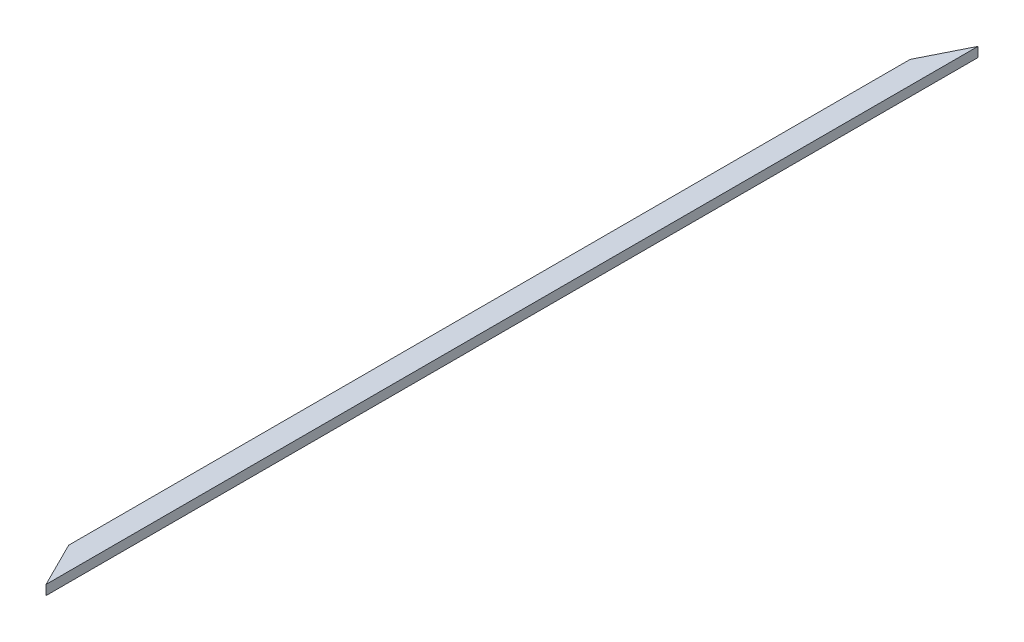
ISO-10303-21;
HEADER;
FILE_DESCRIPTION(('STEP AP214'),'2;1');
FILE_NAME('part.step','',(''),(''),'','','');
FILE_SCHEMA(('AUTOMOTIVE_DESIGN { 1 0 10303 214 1 1 1 1 }'));
ENDSEC;
DATA;
#1=APPLICATION_CONTEXT('core data for automotive mechanical design processes');
#2=APPLICATION_PROTOCOL_DEFINITION('international standard','automotive_design',2000,#1);
#3=PRODUCT_CONTEXT('',#1,'mechanical');
#4=PRODUCT('Part','Part','',(#3));
#5=PRODUCT_RELATED_PRODUCT_CATEGORY('part','',(#4));
#6=PRODUCT_DEFINITION_FORMATION('','',#4);
#7=PRODUCT_DEFINITION_CONTEXT('part definition',#1,'design');
#8=PRODUCT_DEFINITION('design','',#6,#7);
#9=PRODUCT_DEFINITION_SHAPE('','',#8);
#10=(LENGTH_UNIT() NAMED_UNIT(*) SI_UNIT(.MILLI.,.METRE.));
#11=(NAMED_UNIT(*) PLANE_ANGLE_UNIT() SI_UNIT($,.RADIAN.));
#12=(NAMED_UNIT(*) SI_UNIT($,.STERADIAN.) SOLID_ANGLE_UNIT());
#13=UNCERTAINTY_MEASURE_WITH_UNIT(LENGTH_MEASURE(1.E-05),#10,'distance_accuracy_value','');
#14=(GEOMETRIC_REPRESENTATION_CONTEXT(3) GLOBAL_UNCERTAINTY_ASSIGNED_CONTEXT((#13)) GLOBAL_UNIT_ASSIGNED_CONTEXT((#10,
#11,#12)) REPRESENTATION_CONTEXT('',''));
#15=CARTESIAN_POINT('',(0.,0.,0.));
#16=DIRECTION('',(0.,0.,1.));
#17=DIRECTION('',(1.,0.,0.));
#18=AXIS2_PLACEMENT_3D('',#15,#16,#17);
#19=CARTESIAN_POINT('',(-88.9000000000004,38.1,177.761613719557));
#20=DIRECTION('',(0.894388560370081,0.,0.447290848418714));
#21=DIRECTION('',(0.447290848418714,0.,-0.894388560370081));
#22=AXIS2_PLACEMENT_3D('',#19,#20,#21);
#23=PLANE('',#22);
#24=DIRECTION('',(-0.447290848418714,0.,0.894388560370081));
#25=VECTOR('',#24,1.);
#26=CARTESIAN_POINT('',(-88.9000000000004,0.,177.761613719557));
#27=LINE('',#26,#25);
#28=CARTESIAN_POINT('',(0.,0.,0.));
#29=VERTEX_POINT('',#28);
#30=CARTESIAN_POINT('',(-88.9000000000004,0.,177.761613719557));
#31=VERTEX_POINT('',#30);
#32=EDGE_CURVE('E96',#29,#31,#27,.T.);
#33=ORIENTED_EDGE('',*,*,#32,.T.);
#34=DIRECTION('',(0.,-1.,0.));
#35=VECTOR('',#34,1.);
#36=CARTESIAN_POINT('',(-88.9000000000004,38.1,177.761613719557));
#37=LINE('',#36,#35);
#38=CARTESIAN_POINT('',(-88.9000000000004,38.1,177.761613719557));
#39=VERTEX_POINT('',#38);
#40=EDGE_CURVE('E11',#39,#31,#37,.T.);
#41=ORIENTED_EDGE('',*,*,#40,.F.);
#42=DIRECTION('',(-0.447290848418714,0.,0.894388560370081));
#43=VECTOR('',#42,1.);
#44=CARTESIAN_POINT('',(-88.9000000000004,38.1,177.761613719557));
#45=LINE('',#44,#43);
#46=CARTESIAN_POINT('',(0.,38.1,0.));
#47=VERTEX_POINT('',#46);
#48=EDGE_CURVE('E84',#47,#39,#45,.T.);
#49=ORIENTED_EDGE('',*,*,#48,.F.);
#50=DIRECTION('',(0.,-1.,0.));
#51=VECTOR('',#50,1.);
#52=CARTESIAN_POINT('',(0.,38.1,0.));
#53=LINE('',#52,#51);
#54=EDGE_CURVE('E92',#47,#29,#53,.T.);
#55=ORIENTED_EDGE('',*,*,#54,.T.);
#56=EDGE_LOOP('',(#33,#41,#49,#55));
#57=FACE_BOUND('',#56,.T.);
#58=ADVANCED_FACE('F33',(#57),#23,.F.);
#59=CARTESIAN_POINT('',(-88.8999999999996,38.1,3479.83838628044));
#60=DIRECTION('',(1.,0.,0.));
#61=DIRECTION('',(0.,0.,-1.));
#62=AXIS2_PLACEMENT_3D('',#59,#60,#61);
#63=PLANE('',#62);
#64=DIRECTION('',(0.,0.,1.));
#65=VECTOR('',#64,1.);
#66=CARTESIAN_POINT('',(-88.8999999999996,0.,3479.83838628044));
#67=LINE('',#66,#65);
#68=CARTESIAN_POINT('',(-88.8999999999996,0.,3479.83838628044));
#69=VERTEX_POINT('',#68);
#70=EDGE_CURVE('E88',#31,#69,#67,.T.);
#71=ORIENTED_EDGE('',*,*,#70,.T.);
#72=DIRECTION('',(0.,-1.,0.));
#73=VECTOR('',#72,1.);
#74=CARTESIAN_POINT('',(-88.8999999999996,38.1,3479.83838628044));
#75=LINE('',#74,#73);
#76=CARTESIAN_POINT('',(-88.8999999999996,38.1,3479.83838628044));
#77=VERTEX_POINT('',#76);
#78=EDGE_CURVE('E41',#77,#69,#75,.T.);
#79=ORIENTED_EDGE('',*,*,#78,.F.);
#80=DIRECTION('',(0.,0.,1.));
#81=VECTOR('',#80,1.);
#82=CARTESIAN_POINT('',(-88.8999999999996,38.1,3479.83838628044));
#83=LINE('',#82,#81);
#84=EDGE_CURVE('E79',#39,#77,#83,.T.);
#85=ORIENTED_EDGE('',*,*,#84,.F.);
#86=ORIENTED_EDGE('',*,*,#40,.T.);
#87=EDGE_LOOP('',(#71,#79,#85,#86));
#88=FACE_BOUND('',#87,.T.);
#89=ADVANCED_FACE('F87',(#88),#63,.F.);
#90=CARTESIAN_POINT('',(4.47558656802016E-13,38.1,3657.6));
#91=DIRECTION('',(0.894388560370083,0.,-0.447290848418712));
#92=DIRECTION('',(-0.447290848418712,0.,-0.894388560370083));
#93=AXIS2_PLACEMENT_3D('',#90,#91,#92);
#94=PLANE('',#93);
#95=DIRECTION('',(0.447290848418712,0.,0.894388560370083));
#96=VECTOR('',#95,1.);
#97=CARTESIAN_POINT('',(4.47558656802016E-13,0.,3657.6));
#98=LINE('',#97,#96);
#99=CARTESIAN_POINT('',(4.47558656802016E-13,0.,3657.6));
#100=VERTEX_POINT('',#99);
#101=EDGE_CURVE('E66',#69,#100,#98,.T.);
#102=ORIENTED_EDGE('',*,*,#101,.T.);
#103=DIRECTION('',(0.,-1.,0.));
#104=VECTOR('',#103,1.);
#105=CARTESIAN_POINT('',(4.47558656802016E-13,38.1,3657.6));
#106=LINE('',#105,#104);
#107=CARTESIAN_POINT('',(4.47558656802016E-13,38.1,3657.6));
#108=VERTEX_POINT('',#107);
#109=EDGE_CURVE('E89',#108,#100,#106,.T.);
#110=ORIENTED_EDGE('',*,*,#109,.F.);
#111=DIRECTION('',(0.447290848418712,0.,0.894388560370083));
#112=VECTOR('',#111,1.);
#113=CARTESIAN_POINT('',(4.47558656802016E-13,38.1,3657.6));
#114=LINE('',#113,#112);
#115=EDGE_CURVE('E82',#77,#108,#114,.T.);
#116=ORIENTED_EDGE('',*,*,#115,.F.);
#117=ORIENTED_EDGE('',*,*,#78,.T.);
#118=EDGE_LOOP('',(#102,#110,#116,#117));
#119=FACE_BOUND('',#118,.T.);
#120=ADVANCED_FACE('F90',(#119),#94,.F.);
#121=CARTESIAN_POINT('',(0.,38.1,0.));
#122=DIRECTION('',(-1.,0.,0.));
#123=DIRECTION('',(0.,0.,1.));
#124=AXIS2_PLACEMENT_3D('',#121,#122,#123);
#125=PLANE('',#124);
#126=DIRECTION('',(0.,0.,-1.));
#127=VECTOR('',#126,1.);
#128=CARTESIAN_POINT('',(0.,0.,0.));
#129=LINE('',#128,#127);
#130=EDGE_CURVE('E72',#100,#29,#129,.T.);
#131=ORIENTED_EDGE('',*,*,#130,.T.);
#132=ORIENTED_EDGE('',*,*,#54,.F.);
#133=DIRECTION('',(0.,0.,-1.));
#134=VECTOR('',#133,1.);
#135=CARTESIAN_POINT('',(0.,38.1,0.));
#136=LINE('',#135,#134);
#137=EDGE_CURVE('E49',#108,#47,#136,.T.);
#138=ORIENTED_EDGE('',*,*,#137,.F.);
#139=ORIENTED_EDGE('',*,*,#109,.T.);
#140=EDGE_LOOP('',(#131,#132,#138,#139));
#141=FACE_BOUND('',#140,.T.);
#142=ADVANCED_FACE('F103',(#141),#125,.F.);
#143=CARTESIAN_POINT('',(0.,38.1,0.));
#144=DIRECTION('',(0.,1.,0.));
#145=DIRECTION('',(0.,0.,1.));
#146=AXIS2_PLACEMENT_3D('',#143,#144,#145);
#147=PLANE('',#146);
#148=ORIENTED_EDGE('',*,*,#48,.T.);
#149=ORIENTED_EDGE('',*,*,#84,.T.);
#150=ORIENTED_EDGE('',*,*,#115,.T.);
#151=ORIENTED_EDGE('',*,*,#137,.T.);
#152=EDGE_LOOP('',(#148,#149,#150,#151));
#153=FACE_BOUND('',#152,.T.);
#154=ADVANCED_FACE('F80',(#153),#147,.T.);
#155=CARTESIAN_POINT('',(0.,0.,0.));
#156=DIRECTION('',(0.,1.,0.));
#157=DIRECTION('',(0.,0.,1.));
#158=AXIS2_PLACEMENT_3D('',#155,#156,#157);
#159=PLANE('',#158);
#160=ORIENTED_EDGE('',*,*,#32,.F.);
#161=ORIENTED_EDGE('',*,*,#130,.F.);
#162=ORIENTED_EDGE('',*,*,#101,.F.);
#163=ORIENTED_EDGE('',*,*,#70,.F.);
#164=EDGE_LOOP('',(#160,#161,#162,#163));
#165=FACE_BOUND('',#164,.T.);
#166=ADVANCED_FACE('F106',(#165),#159,.F.);
#167=CLOSED_SHELL('',(#58,#89,#120,#142,#154,#166));
#168=MANIFOLD_SOLID_BREP('B2',#167);
#169=ADVANCED_BREP_SHAPE_REPRESENTATION('',(#18,#168),#14);
#170=SHAPE_DEFINITION_REPRESENTATION(#9,#169);
ENDSEC;
END-ISO-10303-21;
